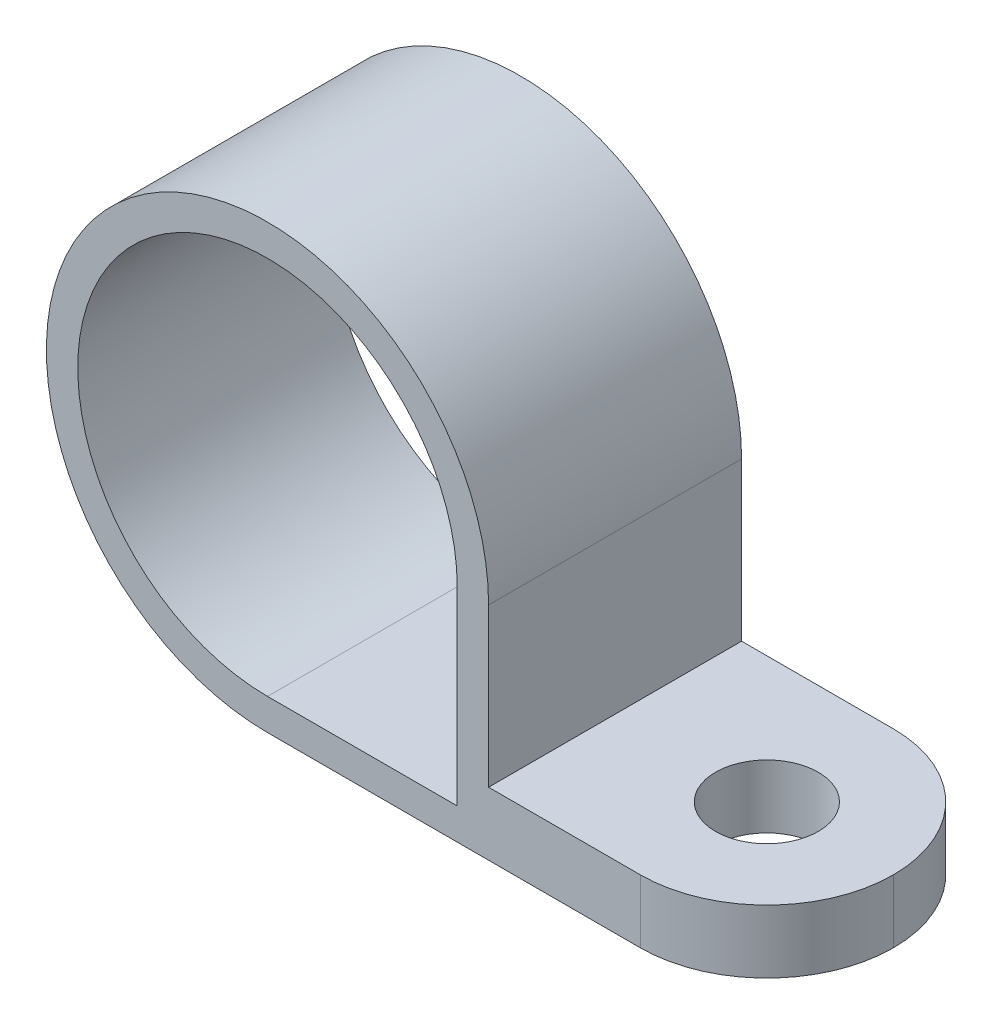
ISO-10303-21;
HEADER;
FILE_DESCRIPTION(('STEP AP214'),'2;1');
FILE_NAME('part.step','',(''),(''),'','','');
FILE_SCHEMA(('AUTOMOTIVE_DESIGN { 1 0 10303 214 1 1 1 1 }'));
ENDSEC;
DATA;
#1=APPLICATION_CONTEXT('core data for automotive mechanical design processes');
#2=APPLICATION_PROTOCOL_DEFINITION('international standard','automotive_design',2000,#1);
#3=PRODUCT_CONTEXT('',#1,'mechanical');
#4=PRODUCT('Part','Part','',(#3));
#5=PRODUCT_RELATED_PRODUCT_CATEGORY('part','',(#4));
#6=PRODUCT_DEFINITION_FORMATION('','',#4);
#7=PRODUCT_DEFINITION_CONTEXT('part definition',#1,'design');
#8=PRODUCT_DEFINITION('design','',#6,#7);
#9=PRODUCT_DEFINITION_SHAPE('','',#8);
#10=(LENGTH_UNIT() NAMED_UNIT(*) SI_UNIT(.MILLI.,.METRE.));
#11=(NAMED_UNIT(*) PLANE_ANGLE_UNIT() SI_UNIT($,.RADIAN.));
#12=(NAMED_UNIT(*) SI_UNIT($,.STERADIAN.) SOLID_ANGLE_UNIT());
#13=UNCERTAINTY_MEASURE_WITH_UNIT(LENGTH_MEASURE(1.E-05),#10,'distance_accuracy_value','');
#14=(GEOMETRIC_REPRESENTATION_CONTEXT(3) GLOBAL_UNCERTAINTY_ASSIGNED_CONTEXT((#13)) GLOBAL_UNIT_ASSIGNED_CONTEXT((#10,
#11,#12)) REPRESENTATION_CONTEXT('',''));
#15=CARTESIAN_POINT('',(0.,0.,0.));
#16=DIRECTION('',(0.,0.,1.));
#17=DIRECTION('',(1.,0.,0.));
#18=AXIS2_PLACEMENT_3D('',#15,#16,#17);
#19=CARTESIAN_POINT('',(0.,0.,12.7));
#20=DIRECTION('',(0.,0.,1.));
#21=DIRECTION('',(1.,0.,0.));
#22=AXIS2_PLACEMENT_3D('',#19,#20,#21);
#23=PLANE('',#22);
#24=DIRECTION('',(1.,0.,0.));
#25=VECTOR('',#24,1.);
#26=CARTESIAN_POINT('',(0.,-11.0998,12.7));
#27=LINE('',#26,#25);
#28=CARTESIAN_POINT('',(0.,-11.0998,12.7));
#29=VERTEX_POINT('',#28);
#30=CARTESIAN_POINT('',(18.7198,-11.0998,12.7));
#31=VERTEX_POINT('',#30);
#32=EDGE_CURVE('E498',#29,#31,#27,.T.);
#33=ORIENTED_EDGE('',*,*,#32,.T.);
#34=DIRECTION('',(0.,1.,0.));
#35=VECTOR('',#34,1.);
#36=CARTESIAN_POINT('',(18.7198,-7.9248,12.7));
#37=LINE('',#36,#35);
#38=CARTESIAN_POINT('',(18.7198,-7.9248,12.7));
#39=VERTEX_POINT('',#38);
#40=EDGE_CURVE('E11',#31,#39,#37,.T.);
#41=ORIENTED_EDGE('',*,*,#40,.T.);
#42=DIRECTION('',(-1.,0.,0.));
#43=VECTOR('',#42,1.);
#44=CARTESIAN_POINT('',(11.0998,-7.9248,12.7));
#45=LINE('',#44,#43);
#46=CARTESIAN_POINT('',(11.0998,-7.9248,12.7));
#47=VERTEX_POINT('',#46);
#48=EDGE_CURVE('E500',#39,#47,#45,.T.);
#49=ORIENTED_EDGE('',*,*,#48,.T.);
#50=DIRECTION('',(0.,1.,0.));
#51=VECTOR('',#50,1.);
#52=CARTESIAN_POINT('',(11.0998,0.,12.7));
#53=LINE('',#52,#51);
#54=CARTESIAN_POINT('',(11.0998,0.,12.7));
#55=VERTEX_POINT('',#54);
#56=EDGE_CURVE('E502',#47,#55,#53,.T.);
#57=ORIENTED_EDGE('',*,*,#56,.T.);
#58=CARTESIAN_POINT('',(0.,0.,12.7));
#59=DIRECTION('',(0.,0.,1.));
#60=DIRECTION('',(1.,0.,0.));
#61=AXIS2_PLACEMENT_3D('',#58,#59,#60);
#62=CIRCLE('',#61,11.0998);
#63=EDGE_CURVE('E495',#55,#29,#62,.T.);
#64=ORIENTED_EDGE('',*,*,#63,.T.);
#65=EDGE_LOOP('',(#33,#41,#49,#57,#64));
#66=FACE_BOUND('',#65,.T.);
#67=DIRECTION('',(1.,0.,0.));
#68=VECTOR('',#67,1.);
#69=CARTESIAN_POINT('',(9.525,-9.525,12.7));
#70=LINE('',#69,#68);
#71=CARTESIAN_POINT('',(0.,-9.525,12.7));
#72=VERTEX_POINT('',#71);
#73=CARTESIAN_POINT('',(9.525,-9.525,12.7));
#74=VERTEX_POINT('',#73);
#75=EDGE_CURVE('E480',#72,#74,#70,.T.);
#76=ORIENTED_EDGE('',*,*,#75,.F.);
#77=CARTESIAN_POINT('',(0.,0.,12.7));
#78=DIRECTION('',(0.,0.,1.));
#79=DIRECTION('',(1.,0.,0.));
#80=AXIS2_PLACEMENT_3D('',#77,#78,#79);
#81=CIRCLE('',#80,9.525);
#82=CARTESIAN_POINT('',(9.525,0.,12.7));
#83=VERTEX_POINT('',#82);
#84=EDGE_CURVE('E467',#83,#72,#81,.T.);
#85=ORIENTED_EDGE('',*,*,#84,.F.);
#86=DIRECTION('',(0.,1.,0.));
#87=VECTOR('',#86,1.);
#88=CARTESIAN_POINT('',(9.525,0.,12.7));
#89=LINE('',#88,#87);
#90=EDGE_CURVE('E482',#74,#83,#89,.T.);
#91=ORIENTED_EDGE('',*,*,#90,.F.);
#92=EDGE_LOOP('',(#76,#85,#91));
#93=FACE_BOUND('',#92,.T.);
#94=ADVANCED_FACE('F381',(#66,#93),#23,.T.);
#95=CARTESIAN_POINT('',(0.,0.,0.));
#96=DIRECTION('',(0.,0.,1.));
#97=DIRECTION('',(1.,0.,0.));
#98=AXIS2_PLACEMENT_3D('',#95,#96,#97);
#99=PLANE('',#98);
#100=DIRECTION('',(-1.,0.,0.));
#101=VECTOR('',#100,1.);
#102=CARTESIAN_POINT('',(11.0998,-7.9248,0.));
#103=LINE('',#102,#101);
#104=CARTESIAN_POINT('',(18.7198,-7.9248,0.));
#105=VERTEX_POINT('',#104);
#106=CARTESIAN_POINT('',(11.0998,-7.9248,0.));
#107=VERTEX_POINT('',#106);
#108=EDGE_CURVE('E491',#105,#107,#103,.T.);
#109=ORIENTED_EDGE('',*,*,#108,.F.);
#110=DIRECTION('',(0.,1.,0.));
#111=VECTOR('',#110,1.);
#112=CARTESIAN_POINT('',(18.7198,0.,0.));
#113=LINE('',#112,#111);
#114=CARTESIAN_POINT('',(18.7198,-11.0998,0.));
#115=VERTEX_POINT('',#114);
#116=EDGE_CURVE('E517',#105,#115,#113,.F.);
#117=ORIENTED_EDGE('',*,*,#116,.T.);
#118=DIRECTION('',(1.,0.,0.));
#119=VECTOR('',#118,1.);
#120=CARTESIAN_POINT('',(0.,-11.0998,0.));
#121=LINE('',#120,#119);
#122=CARTESIAN_POINT('',(0.,-11.0998,0.));
#123=VERTEX_POINT('',#122);
#124=EDGE_CURVE('E489',#123,#115,#121,.T.);
#125=ORIENTED_EDGE('',*,*,#124,.F.);
#126=CARTESIAN_POINT('',(0.,0.,0.));
#127=DIRECTION('',(0.,0.,1.));
#128=DIRECTION('',(1.,0.,0.));
#129=AXIS2_PLACEMENT_3D('',#126,#127,#128);
#130=CIRCLE('',#129,11.0998);
#131=CARTESIAN_POINT('',(11.0998,0.,0.));
#132=VERTEX_POINT('',#131);
#133=EDGE_CURVE('E468',#132,#123,#130,.T.);
#134=ORIENTED_EDGE('',*,*,#133,.F.);
#135=DIRECTION('',(0.,1.,0.));
#136=VECTOR('',#135,1.);
#137=CARTESIAN_POINT('',(11.0998,0.,0.));
#138=LINE('',#137,#136);
#139=EDGE_CURVE('E493',#107,#132,#138,.T.);
#140=ORIENTED_EDGE('',*,*,#139,.F.);
#141=EDGE_LOOP('',(#109,#117,#125,#134,#140));
#142=FACE_BOUND('',#141,.T.);
#143=CARTESIAN_POINT('',(0.,0.,0.));
#144=DIRECTION('',(0.,0.,1.));
#145=DIRECTION('',(1.,0.,0.));
#146=AXIS2_PLACEMENT_3D('',#143,#144,#145);
#147=CIRCLE('',#146,9.525);
#148=CARTESIAN_POINT('',(9.525,0.,0.));
#149=VERTEX_POINT('',#148);
#150=CARTESIAN_POINT('',(0.,-9.525,0.));
#151=VERTEX_POINT('',#150);
#152=EDGE_CURVE('E460',#149,#151,#147,.T.);
#153=ORIENTED_EDGE('',*,*,#152,.T.);
#154=DIRECTION('',(1.,0.,0.));
#155=VECTOR('',#154,1.);
#156=CARTESIAN_POINT('',(9.525,-9.525,0.));
#157=LINE('',#156,#155);
#158=CARTESIAN_POINT('',(9.525,-9.525,0.));
#159=VERTEX_POINT('',#158);
#160=EDGE_CURVE('E448',#151,#159,#157,.T.);
#161=ORIENTED_EDGE('',*,*,#160,.T.);
#162=DIRECTION('',(0.,1.,0.));
#163=VECTOR('',#162,1.);
#164=CARTESIAN_POINT('',(9.525,0.,0.));
#165=LINE('',#164,#163);
#166=EDGE_CURVE('E459',#159,#149,#165,.T.);
#167=ORIENTED_EDGE('',*,*,#166,.T.);
#168=EDGE_LOOP('',(#153,#161,#167));
#169=FACE_BOUND('',#168,.T.);
#170=ADVANCED_FACE('F470',(#142,#169),#99,.F.);
#171=CARTESIAN_POINT('',(0.,0.,12.7));
#172=DIRECTION('',(0.,0.,-1.));
#173=DIRECTION('',(-1.,0.,0.));
#174=AXIS2_PLACEMENT_3D('',#171,#172,#173);
#175=CYLINDRICAL_SURFACE('',#174,11.0998);
#176=ORIENTED_EDGE('',*,*,#133,.T.);
#177=DIRECTION('',(0.,0.,-1.));
#178=VECTOR('',#177,1.);
#179=CARTESIAN_POINT('',(0.,-11.0998,12.7));
#180=LINE('',#179,#178);
#181=EDGE_CURVE('E510',#29,#123,#180,.T.);
#182=ORIENTED_EDGE('',*,*,#181,.F.);
#183=ORIENTED_EDGE('',*,*,#63,.F.);
#184=DIRECTION('',(0.,0.,-1.));
#185=VECTOR('',#184,1.);
#186=CARTESIAN_POINT('',(11.0998,0.,12.7));
#187=LINE('',#186,#185);
#188=EDGE_CURVE('E504',#55,#132,#187,.T.);
#189=ORIENTED_EDGE('',*,*,#188,.T.);
#190=EDGE_LOOP('',(#176,#182,#183,#189));
#191=FACE_BOUND('',#190,.T.);
#192=ADVANCED_FACE('F383',(#191),#175,.T.);
#193=CARTESIAN_POINT('',(0.,-11.0998,12.7));
#194=DIRECTION('',(0.,1.,0.));
#195=DIRECTION('',(-1.,0.,0.));
#196=AXIS2_PLACEMENT_3D('',#193,#194,#195);
#197=PLANE('',#196);
#198=CARTESIAN_POINT('',(18.7198,-11.0998,6.35));
#199=DIRECTION('',(0.,1.,0.));
#200=DIRECTION('',(0.,0.,1.));
#201=AXIS2_PLACEMENT_3D('',#198,#199,#200);
#202=CIRCLE('',#201,2.5781);
#203=CARTESIAN_POINT('',(18.7198,-11.0998,8.9281));
#204=VERTEX_POINT('',#203);
#205=EDGE_CURVE('E474',#204,#204,#202,.T.);
#206=ORIENTED_EDGE('',*,*,#205,.T.);
#207=EDGE_LOOP('',(#206));
#208=FACE_BOUND('',#207,.T.);
#209=ORIENTED_EDGE('',*,*,#124,.T.);
#210=CARTESIAN_POINT('',(18.7198,-11.0998,6.35));
#211=DIRECTION('',(0.,1.,0.));
#212=DIRECTION('',(-1.,0.,0.));
#213=AXIS2_PLACEMENT_3D('',#210,#211,#212);
#214=CIRCLE('',#213,6.35);
#215=CARTESIAN_POINT('',(25.0698,-11.0998,6.35));
#216=VERTEX_POINT('',#215);
#217=EDGE_CURVE('E389',#115,#216,#214,.F.);
#218=ORIENTED_EDGE('',*,*,#217,.T.);
#219=CARTESIAN_POINT('',(18.7198,-11.0998,6.35));
#220=DIRECTION('',(0.,1.,0.));
#221=DIRECTION('',(-1.,0.,0.));
#222=AXIS2_PLACEMENT_3D('',#219,#220,#221);
#223=CIRCLE('',#222,6.35);
#224=EDGE_CURVE('E396',#216,#31,#223,.F.);
#225=ORIENTED_EDGE('',*,*,#224,.T.);
#226=ORIENTED_EDGE('',*,*,#32,.F.);
#227=ORIENTED_EDGE('',*,*,#181,.T.);
#228=EDGE_LOOP('',(#209,#218,#225,#226,#227));
#229=FACE_BOUND('',#228,.T.);
#230=ADVANCED_FACE('F527',(#208,#229),#197,.F.);
#231=CARTESIAN_POINT('',(11.0998,-7.9248,12.7));
#232=DIRECTION('',(0.,-1.,0.));
#233=DIRECTION('',(0.,0.,-1.));
#234=AXIS2_PLACEMENT_3D('',#231,#232,#233);
#235=PLANE('',#234);
#236=CARTESIAN_POINT('',(18.7198,-7.9248,6.35));
#237=DIRECTION('',(0.,1.,0.));
#238=DIRECTION('',(0.,0.,1.));
#239=AXIS2_PLACEMENT_3D('',#236,#237,#238);
#240=CIRCLE('',#239,2.5781);
#241=CARTESIAN_POINT('',(18.7198,-7.9248,8.9281));
#242=VERTEX_POINT('',#241);
#243=EDGE_CURVE('E579',#242,#242,#240,.T.);
#244=ORIENTED_EDGE('',*,*,#243,.F.);
#245=EDGE_LOOP('',(#244));
#246=FACE_BOUND('',#245,.T.);
#247=CARTESIAN_POINT('',(18.7198,-7.9248,6.35));
#248=DIRECTION('',(0.,-1.,0.));
#249=DIRECTION('',(0.,0.,-1.));
#250=AXIS2_PLACEMENT_3D('',#247,#248,#249);
#251=CIRCLE('',#250,6.35);
#252=CARTESIAN_POINT('',(25.0698,-7.9248,6.35));
#253=VERTEX_POINT('',#252);
#254=EDGE_CURVE('E513',#39,#253,#251,.F.);
#255=ORIENTED_EDGE('',*,*,#254,.T.);
#256=CARTESIAN_POINT('',(18.7198,-7.9248,6.35));
#257=DIRECTION('',(0.,-1.,0.));
#258=DIRECTION('',(0.,0.,-1.));
#259=AXIS2_PLACEMENT_3D('',#256,#257,#258);
#260=CIRCLE('',#259,6.35);
#261=EDGE_CURVE('E515',#253,#105,#260,.F.);
#262=ORIENTED_EDGE('',*,*,#261,.T.);
#263=ORIENTED_EDGE('',*,*,#108,.T.);
#264=DIRECTION('',(0.,0.,-1.));
#265=VECTOR('',#264,1.);
#266=CARTESIAN_POINT('',(11.0998,-7.9248,12.7));
#267=LINE('',#266,#265);
#268=EDGE_CURVE('E507',#47,#107,#267,.T.);
#269=ORIENTED_EDGE('',*,*,#268,.F.);
#270=ORIENTED_EDGE('',*,*,#48,.F.);
#271=EDGE_LOOP('',(#255,#262,#263,#269,#270));
#272=FACE_BOUND('',#271,.T.);
#273=ADVANCED_FACE('F538',(#246,#272),#235,.F.);
#274=CARTESIAN_POINT('',(11.0998,0.,12.7));
#275=DIRECTION('',(-1.,0.,0.));
#276=DIRECTION('',(0.,-1.,0.));
#277=AXIS2_PLACEMENT_3D('',#274,#275,#276);
#278=PLANE('',#277);
#279=ORIENTED_EDGE('',*,*,#139,.T.);
#280=ORIENTED_EDGE('',*,*,#188,.F.);
#281=ORIENTED_EDGE('',*,*,#56,.F.);
#282=ORIENTED_EDGE('',*,*,#268,.T.);
#283=EDGE_LOOP('',(#279,#280,#281,#282));
#284=FACE_BOUND('',#283,.T.);
#285=ADVANCED_FACE('F533',(#284),#278,.F.);
#286=CARTESIAN_POINT('',(0.,0.,12.7));
#287=DIRECTION('',(0.,0.,-1.));
#288=DIRECTION('',(-1.,0.,0.));
#289=AXIS2_PLACEMENT_3D('',#286,#287,#288);
#290=CYLINDRICAL_SURFACE('',#289,9.525);
#291=ORIENTED_EDGE('',*,*,#152,.F.);
#292=DIRECTION('',(0.,0.,-1.));
#293=VECTOR('',#292,1.);
#294=CARTESIAN_POINT('',(9.525,0.,12.7));
#295=LINE('',#294,#293);
#296=EDGE_CURVE('E484',#83,#149,#295,.T.);
#297=ORIENTED_EDGE('',*,*,#296,.F.);
#298=ORIENTED_EDGE('',*,*,#84,.T.);
#299=DIRECTION('',(0.,0.,-1.));
#300=VECTOR('',#299,1.);
#301=CARTESIAN_POINT('',(0.,-9.525,12.7));
#302=LINE('',#301,#300);
#303=EDGE_CURVE('E452',#72,#151,#302,.T.);
#304=ORIENTED_EDGE('',*,*,#303,.T.);
#305=EDGE_LOOP('',(#291,#297,#298,#304));
#306=FACE_BOUND('',#305,.T.);
#307=ADVANCED_FACE('F463',(#306),#290,.F.);
#308=CARTESIAN_POINT('',(9.525,-9.525,12.7));
#309=DIRECTION('',(0.,1.,0.));
#310=DIRECTION('',(-1.,0.,0.));
#311=AXIS2_PLACEMENT_3D('',#308,#309,#310);
#312=PLANE('',#311);
#313=ORIENTED_EDGE('',*,*,#160,.F.);
#314=ORIENTED_EDGE('',*,*,#303,.F.);
#315=ORIENTED_EDGE('',*,*,#75,.T.);
#316=DIRECTION('',(0.,0.,-1.));
#317=VECTOR('',#316,1.);
#318=CARTESIAN_POINT('',(9.525,-9.525,12.7));
#319=LINE('',#318,#317);
#320=EDGE_CURVE('E454',#74,#159,#319,.T.);
#321=ORIENTED_EDGE('',*,*,#320,.T.);
#322=EDGE_LOOP('',(#313,#314,#315,#321));
#323=FACE_BOUND('',#322,.T.);
#324=ADVANCED_FACE('F450',(#323),#312,.T.);
#325=CARTESIAN_POINT('',(9.525,0.,12.7));
#326=DIRECTION('',(-1.,0.,0.));
#327=DIRECTION('',(0.,-1.,0.));
#328=AXIS2_PLACEMENT_3D('',#325,#326,#327);
#329=PLANE('',#328);
#330=ORIENTED_EDGE('',*,*,#166,.F.);
#331=ORIENTED_EDGE('',*,*,#320,.F.);
#332=ORIENTED_EDGE('',*,*,#90,.T.);
#333=ORIENTED_EDGE('',*,*,#296,.T.);
#334=EDGE_LOOP('',(#330,#331,#332,#333));
#335=FACE_BOUND('',#334,.T.);
#336=ADVANCED_FACE('F551',(#335),#329,.T.);
#337=CARTESIAN_POINT('',(18.7198,0.,6.35));
#338=DIRECTION('',(0.,-1.,0.));
#339=DIRECTION('',(0.,0.,-1.));
#340=AXIS2_PLACEMENT_3D('',#337,#338,#339);
#341=CYLINDRICAL_SURFACE('',#340,6.35);
#342=ORIENTED_EDGE('',*,*,#40,.F.);
#343=ORIENTED_EDGE('',*,*,#224,.F.);
#344=DIRECTION('',(0.,1.,0.));
#345=VECTOR('',#344,1.);
#346=CARTESIAN_POINT('',(25.0698,-11.0998,6.35));
#347=LINE('',#346,#345);
#348=EDGE_CURVE('E471',#253,#216,#347,.F.);
#349=ORIENTED_EDGE('',*,*,#348,.F.);
#350=ORIENTED_EDGE('',*,*,#254,.F.);
#351=EDGE_LOOP('',(#342,#343,#349,#350));
#352=FACE_BOUND('',#351,.T.);
#353=ADVANCED_FACE('F544',(#352),#341,.T.);
#354=CARTESIAN_POINT('',(18.7198,-7.9248,6.35));
#355=DIRECTION('',(0.,1.,0.));
#356=DIRECTION('',(0.,0.,1.));
#357=AXIS2_PLACEMENT_3D('',#354,#355,#356);
#358=CYLINDRICAL_SURFACE('',#357,6.35);
#359=ORIENTED_EDGE('',*,*,#217,.F.);
#360=ORIENTED_EDGE('',*,*,#116,.F.);
#361=ORIENTED_EDGE('',*,*,#261,.F.);
#362=ORIENTED_EDGE('',*,*,#348,.T.);
#363=EDGE_LOOP('',(#359,#360,#361,#362));
#364=FACE_BOUND('',#363,.T.);
#365=ADVANCED_FACE('F541',(#364),#358,.T.);
#366=CARTESIAN_POINT('',(18.7198,-11.0998,6.35));
#367=DIRECTION('',(0.,1.,0.));
#368=DIRECTION('',(0.,0.,1.));
#369=AXIS2_PLACEMENT_3D('',#366,#367,#368);
#370=CYLINDRICAL_SURFACE('',#369,2.5781);
#371=ORIENTED_EDGE('',*,*,#205,.F.);
#372=EDGE_LOOP('',(#371));
#373=FACE_BOUND('',#372,.T.);
#374=ORIENTED_EDGE('',*,*,#243,.T.);
#375=EDGE_LOOP('',(#374));
#376=FACE_BOUND('',#375,.T.);
#377=ADVANCED_FACE('F584',(#373,#376),#370,.F.);
#378=CLOSED_SHELL('',(#94,#170,#192,#230,#273,#285,#307,#324,#336,#353,#365,#377));
#379=MANIFOLD_SOLID_BREP('B2',#378);
#380=ADVANCED_BREP_SHAPE_REPRESENTATION('',(#18,#379),#14);
#381=SHAPE_DEFINITION_REPRESENTATION(#9,#380);
ENDSEC;
END-ISO-10303-21;
